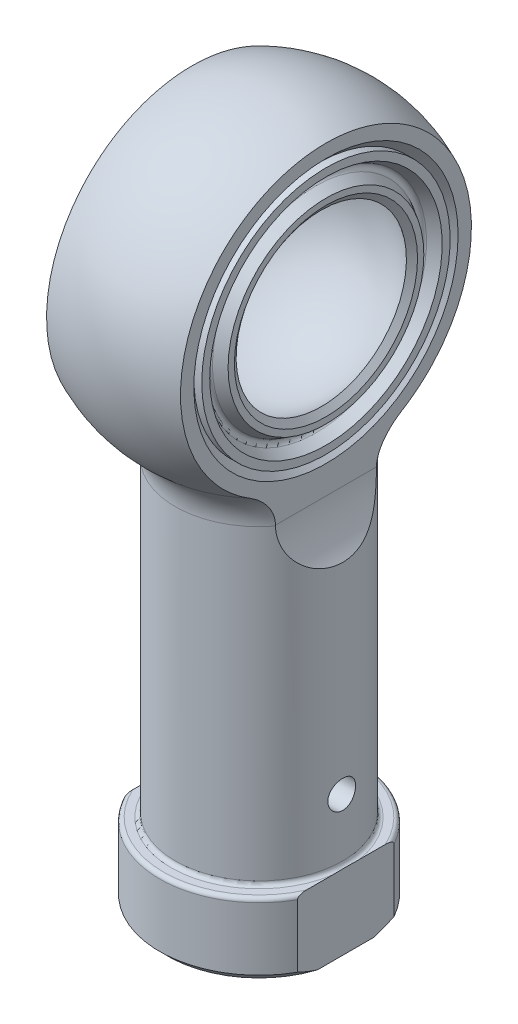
from build123d import *

# Parameters (mm, degrees)
CHAMFER1_SIZE           = 0.508
FILLET1_R               = 3.048
FILLET2_R               = 0.254
CUT_EXTRUDE1_DEPTH      = 48.42460929
CUT_EXTRUDE1_DEPTH_BACK = 48.42460929
SKETCH2_OUTSIDE_W       = 33.2
SKETCH2_OUTSIDE_H       = 57.889
CUT_EXTRUDE2_DEPTH      = 47.638129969
CUT_EXTRUDE2_DEPTH_BACK = 47.638129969
SKETCH3_R               = 7.9375
SKETCH3_R_2             = 0.889
CHAMFER2_SIZE           = 0.508


with BuildPart() as part:
    # Sketch1 → Revolve1 (revolve)
    with BuildSketch(Plane.XY, mode=Mode.PRIVATE) as revolve1_sk:
        with BuildLine():
            Line((3.571875, 0), (6.35, 0))
            Line((6.35, 0), (6.35, 4.7752))
            Line((6.35, 4.7752), (5.3594, 4.7752))
            Line((5.3594, 4.7752), (5.3594, 26.203955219))
            ThreePointArc((5.3594, 26.203955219), (9.850130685, 37.709729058), (0, 45.1612))
            Line((0, 45.1612), (0, 34.925))
            Line((0, 34.925), (0.889, 34.036))
            Line((0.889, 34.036), (0.889, 23.684415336))
            Line((0.889, 23.684415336), (3.317875, 22.225))
            Line((3.317875, 22.225), (3.317875, 19.05))
            Line((3.317875, 19.05), (3.571875, 19.05))
            Line((3.571875, 19.05), (3.571875, 0))
        make_face()
    revolve(revolve1_sk.sketch.rotate(Axis((0, -1004.593899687, 0), (0, 1, 0)), 90), axis=Axis((0, -1004.593899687, 0), (0, 1, 0)))

    # Chamfer1
    chamfer1_edges = [part.edges().sort_by_distance(p)[0] for p in [
        (0, 0, 6.35),
    ]]
    chamfer(chamfer1_edges, length=CHAMFER1_SIZE)

    # Fillet1
    fillet1_edges = [part.edges().sort_by_distance(p)[0] for p in [
        (0, 26.203955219, 5.3594),
    ]]
    fillet(fillet1_edges, radius=FILLET1_R)

    # Fillet2
    fillet2_edges = [part.edges().sort_by_distance(p)[0] for p in [
        (0, 4.7752, 6.35),
        (0, 4.7752, 5.3594),
    ]]
    fillet(fillet2_edges, radius=FILLET2_R)

    # Sketch2 outside → Cut-Extrude1 (cut, two sides: drawn at the far end of the back side and taken through both)
    with BuildSketch(Plane.XY.offset(-CUT_EXTRUDE1_DEPTH_BACK)):
        with Locations((0, 22.5805)):
            Rectangle(SKETCH2_OUTSIDE_W, SKETCH2_OUTSIDE_H)
        with BuildLine():
            Line((-5.5499, 0), (5.5499, 0))
            Line((5.5499, 0), (5.5499, 21.328695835))
            ThreePointArc((5.5499, 21.328695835), (4.607995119, 22.892748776), (4.2799, 24.6888))
            Line((4.2799, 24.6888), (4.2799, 45.1612))
            Line((4.2799, 45.1612), (-4.2799, 45.1612))
            Line((-4.2799, 45.1612), (-4.2799, 24.6888))
            ThreePointArc((-4.2799, 24.6888), (-4.607995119, 22.892748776), (-5.5499, 21.328695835))
            Line((-5.5499, 21.328695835), (-5.5499, 0))
        make_face(mode=Mode.SUBTRACT)
    extrude(amount=CUT_EXTRUDE1_DEPTH + CUT_EXTRUDE1_DEPTH_BACK, mode=Mode.SUBTRACT)

    # Sketch3 → Cut-Extrude2 (cut, two sides: drawn at the far end of the back side and taken through both)
    with BuildSketch(Plane(origin=(0, 0, 0), x_dir=(0, 0, -1), z_dir=(1, 0, 0)).offset(-CUT_EXTRUDE2_DEPTH_BACK)):
        with Locations(Location((0, 34.925, 0), (0, 0, 90))):
            Circle(SKETCH3_R)
        with Locations((0, 8.71855)):
            Circle(SKETCH3_R_2)
    extrude(amount=CUT_EXTRUDE2_DEPTH + CUT_EXTRUDE2_DEPTH_BACK, mode=Mode.SUBTRACT)

    # Chamfer2
    chamfer2_edges = [part.edges().sort_by_distance(p)[0] for p in [
        (4.2799, 26.9875, 0),
        (-4.2799, 26.9875, 0),
    ]]
    chamfer(chamfer2_edges, length=CHAMFER2_SIZE)


with BuildPart() as body_2:
    # Sketch4 → Revolve2 (revolve)
    with BuildSketch(Plane.XY, mode=Mode.PRIVATE) as revolve2_sk:
        with BuildLine():
            Line((3.980082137, 40.368935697), (4.2799, 40.779025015))
            Line((4.2799, 40.779025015), (4.2799, 41.181324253))
            Line((4.2799, 41.181324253), (3.6449, 41.547941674))
            ThreePointArc((3.6449, 41.547941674), (3.5179, 41.767912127), (3.6449, 41.987882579))
            Line((3.6449, 41.987882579), (4.2799, 42.3545))
            Line((4.2799, 42.3545), (4.2799, 42.8625))
            Line((4.2799, 42.8625), (-4.2799, 42.8625))
            Line((-4.2799, 42.8625), (-4.2799, 42.3545))
            Line((-4.2799, 42.3545), (-3.6449, 41.987882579))
            ThreePointArc((-3.6449, 41.987882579), (-3.5179, 41.767912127), (-3.6449, 41.547941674))
            Line((-3.6449, 41.547941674), (-4.2799, 41.181324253))
            Line((-4.2799, 41.181324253), (-4.2799, 40.779025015))
            Line((-4.2799, 40.779025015), (-3.980082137, 40.368935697))
            ThreePointArc((-3.980082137, 40.368935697), (0, 41.6687), (3.980082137, 40.368935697))
        make_face()
    revolve(revolve2_sk.sketch.rotate(Axis((-14.449204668, 34.925, 0), (1, 0, 0)), 90), axis=Axis((-14.449204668, 34.925, 0), (1, 0, 0)))


solid = Compound([part.part, body_2.part])
